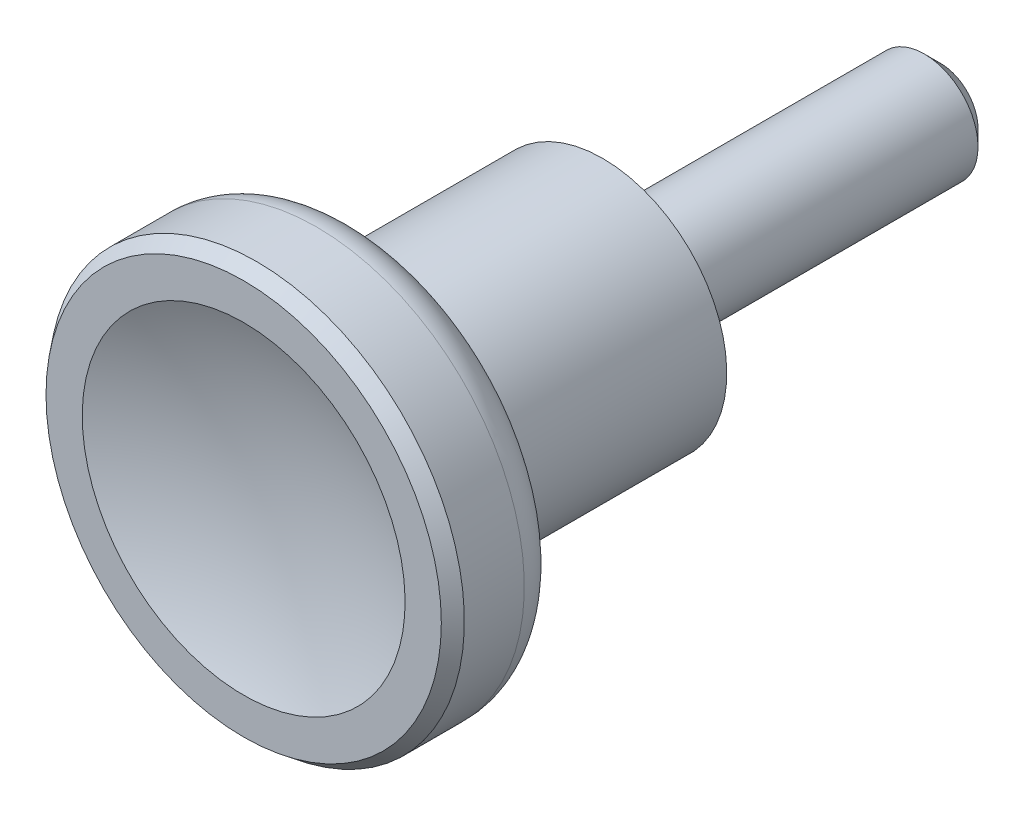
ISO-10303-21;
HEADER;
FILE_DESCRIPTION(('STEP AP214'),'2;1');
FILE_NAME('part.step','',(''),(''),'','','');
FILE_SCHEMA(('AUTOMOTIVE_DESIGN { 1 0 10303 214 1 1 1 1 }'));
ENDSEC;
DATA;
#1=APPLICATION_CONTEXT('core data for automotive mechanical design processes');
#2=APPLICATION_PROTOCOL_DEFINITION('international standard','automotive_design',2000,#1);
#3=PRODUCT_CONTEXT('',#1,'mechanical');
#4=PRODUCT('Part','Part','',(#3));
#5=PRODUCT_RELATED_PRODUCT_CATEGORY('part','',(#4));
#6=PRODUCT_DEFINITION_FORMATION('','',#4);
#7=PRODUCT_DEFINITION_CONTEXT('part definition',#1,'design');
#8=PRODUCT_DEFINITION('design','',#6,#7);
#9=PRODUCT_DEFINITION_SHAPE('','',#8);
#10=(LENGTH_UNIT() NAMED_UNIT(*) SI_UNIT(.MILLI.,.METRE.));
#11=(NAMED_UNIT(*) PLANE_ANGLE_UNIT() SI_UNIT($,.RADIAN.));
#12=(NAMED_UNIT(*) SI_UNIT($,.STERADIAN.) SOLID_ANGLE_UNIT());
#13=UNCERTAINTY_MEASURE_WITH_UNIT(LENGTH_MEASURE(1.E-05),#10,'distance_accuracy_value','');
#14=(GEOMETRIC_REPRESENTATION_CONTEXT(3) GLOBAL_UNCERTAINTY_ASSIGNED_CONTEXT((#13)) GLOBAL_UNIT_ASSIGNED_CONTEXT((#10,
#11,#12)) REPRESENTATION_CONTEXT('',''));
#15=CARTESIAN_POINT('',(0.,0.,0.));
#16=DIRECTION('',(0.,0.,1.));
#17=DIRECTION('',(1.,0.,0.));
#18=AXIS2_PLACEMENT_3D('',#15,#16,#17);
#19=CARTESIAN_POINT('',(9.25,0.,0.2));
#20=DIRECTION('',(0.,0.,1.));
#21=DIRECTION('',(0.,-1.,0.));
#22=AXIS2_PLACEMENT_3D('',#19,#20,#21);
#23=PLANE('',#22);
#24=CARTESIAN_POINT('',(0.,0.,0.2));
#25=DIRECTION('',(0.,0.,-1.));
#26=DIRECTION('',(0.,1.,0.));
#27=AXIS2_PLACEMENT_3D('',#24,#25,#26);
#28=CIRCLE('',#27,5.);
#29=CARTESIAN_POINT('',(0.,5.,0.2));
#30=VERTEX_POINT('',#29);
#31=EDGE_CURVE('E56',#30,#30,#28,.T.);
#32=ORIENTED_EDGE('',*,*,#31,.F.);
#33=EDGE_LOOP('',(#32));
#34=FACE_BOUND('',#33,.T.);
#35=CARTESIAN_POINT('',(0.,0.,0.2));
#36=DIRECTION('',(0.,0.,-1.));
#37=DIRECTION('',(0.,1.,0.));
#38=AXIS2_PLACEMENT_3D('',#35,#36,#37);
#39=CIRCLE('',#38,9.25);
#40=CARTESIAN_POINT('',(0.,9.25,0.2));
#41=VERTEX_POINT('',#40);
#42=EDGE_CURVE('E23',#41,#41,#39,.T.);
#43=ORIENTED_EDGE('',*,*,#42,.T.);
#44=EDGE_LOOP('',(#43));
#45=FACE_BOUND('',#44,.T.);
#46=ADVANCED_FACE('F12',(#34,#45),#23,.F.);
#47=CARTESIAN_POINT('',(0.,0.,-4.9324732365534));
#48=DIRECTION('',(0.,0.,-1.));
#49=DIRECTION('',(0.,1.,0.));
#50=AXIS2_PLACEMENT_3D('',#47,#48,#49);
#51=CYLINDRICAL_SURFACE('',#50,9.25);
#52=CARTESIAN_POINT('',(0.,0.,17.));
#53=DIRECTION('',(0.,0.,-1.));
#54=DIRECTION('',(0.,1.,0.));
#55=AXIS2_PLACEMENT_3D('',#52,#53,#54);
#56=CIRCLE('',#55,9.25);
#57=CARTESIAN_POINT('',(0.,9.25,17.));
#58=VERTEX_POINT('',#57);
#59=EDGE_CURVE('E27',#58,#58,#56,.T.);
#60=ORIENTED_EDGE('',*,*,#59,.T.);
#61=EDGE_LOOP('',(#60));
#62=FACE_BOUND('',#61,.T.);
#63=ORIENTED_EDGE('',*,*,#42,.F.);
#64=EDGE_LOOP('',(#63));
#65=FACE_BOUND('',#64,.T.);
#66=ADVANCED_FACE('F64',(#62,#65),#51,.T.);
#67=CARTESIAN_POINT('',(0.,0.,17.));
#68=DIRECTION('',(0.,0.,-1.));
#69=DIRECTION('',(0.,1.,0.));
#70=AXIS2_PLACEMENT_3D('',#67,#68,#69);
#71=TOROIDAL_SURFACE('',#70,10.0070026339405,0.757002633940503);
#72=ORIENTED_EDGE('',*,*,#59,.F.);
#73=EDGE_LOOP('',(#72));
#74=FACE_BOUND('',#73,.T.);
#75=CARTESIAN_POINT('',(0.,0.,17.7312080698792));
#76=DIRECTION('',(0.,0.,-1.));
#77=DIRECTION('',(0.,1.,0.));
#78=AXIS2_PLACEMENT_3D('',#75,#76,#77);
#79=CIRCLE('',#78,9.81107472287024);
#80=CARTESIAN_POINT('',(0.,9.81107472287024,17.7312080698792));
#81=VERTEX_POINT('',#80);
#82=EDGE_CURVE('E32',#81,#81,#79,.T.);
#83=ORIENTED_EDGE('',*,*,#82,.T.);
#84=EDGE_LOOP('',(#83));
#85=FACE_BOUND('',#84,.T.);
#86=ADVANCED_FACE('F68',(#74,#85),#71,.F.);
#87=CARTESIAN_POINT('',(0.,0.,17.7312080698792));
#88=DIRECTION('',(0.,0.,1.));
#89=DIRECTION('',(0.,-1.,0.));
#90=AXIS2_PLACEMENT_3D('',#87,#88,#89);
#91=CONICAL_SURFACE('',#90,9.81107472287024,1.30899528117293);
#92=CARTESIAN_POINT('',(0.,0.,18.6597619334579));
#93=DIRECTION('',(0.,0.,-1.));
#94=DIRECTION('',(0.,1.,0.));
#95=AXIS2_PLACEMENT_3D('',#92,#93,#94);
#96=CIRCLE('',#95,13.2764619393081);
#97=CARTESIAN_POINT('',(0.,13.2764619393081,18.6597619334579));
#98=VERTEX_POINT('',#97);
#99=EDGE_CURVE('E35',#98,#98,#96,.T.);
#100=ORIENTED_EDGE('',*,*,#99,.T.);
#101=EDGE_LOOP('',(#100));
#102=FACE_BOUND('',#101,.T.);
#103=ORIENTED_EDGE('',*,*,#82,.F.);
#104=EDGE_LOOP('',(#103));
#105=FACE_BOUND('',#104,.T.);
#106=ADVANCED_FACE('F76',(#102,#105),#91,.T.);
#107=CARTESIAN_POINT('',(0.,0.,21.5575381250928));
#108=DIRECTION('',(0.,0.,-1.));
#109=DIRECTION('',(0.,1.,0.));
#110=AXIS2_PLACEMENT_3D('',#107,#108,#109);
#111=TOROIDAL_SURFACE('',#110,12.5,3.);
#112=CARTESIAN_POINT('',(0.,0.,21.5575381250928));
#113=DIRECTION('',(0.,0.,-1.));
#114=DIRECTION('',(0.,1.,0.));
#115=AXIS2_PLACEMENT_3D('',#112,#113,#114);
#116=CIRCLE('',#115,15.5);
#117=CARTESIAN_POINT('',(0.,15.5,21.5575381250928));
#118=VERTEX_POINT('',#117);
#119=EDGE_CURVE('E38',#118,#118,#116,.T.);
#120=ORIENTED_EDGE('',*,*,#119,.T.);
#121=EDGE_LOOP('',(#120));
#122=FACE_BOUND('',#121,.T.);
#123=ORIENTED_EDGE('',*,*,#99,.F.);
#124=EDGE_LOOP('',(#123));
#125=FACE_BOUND('',#124,.T.);
#126=ADVANCED_FACE('F82',(#122,#125),#111,.T.);
#127=CARTESIAN_POINT('',(0.,0.,-4.9324732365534));
#128=DIRECTION('',(0.,0.,-1.));
#129=DIRECTION('',(0.,1.,0.));
#130=AXIS2_PLACEMENT_3D('',#127,#128,#129);
#131=CYLINDRICAL_SURFACE('',#130,15.5);
#132=CARTESIAN_POINT('',(0.,0.,26.0301314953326));
#133=DIRECTION('',(0.,0.,-1.));
#134=DIRECTION('',(0.,1.,0.));
#135=AXIS2_PLACEMENT_3D('',#132,#133,#134);
#136=CIRCLE('',#135,15.5);
#137=CARTESIAN_POINT('',(0.,15.5,26.0301314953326));
#138=VERTEX_POINT('',#137);
#139=EDGE_CURVE('E41',#138,#138,#136,.T.);
#140=ORIENTED_EDGE('',*,*,#139,.T.);
#141=EDGE_LOOP('',(#140));
#142=FACE_BOUND('',#141,.T.);
#143=ORIENTED_EDGE('',*,*,#119,.F.);
#144=EDGE_LOOP('',(#143));
#145=FACE_BOUND('',#144,.T.);
#146=ADVANCED_FACE('F86',(#142,#145),#131,.T.);
#147=CARTESIAN_POINT('',(0.,0.,27.));
#148=DIRECTION('',(0.,0.,-1.));
#149=DIRECTION('',(0.,1.,0.));
#150=AXIS2_PLACEMENT_3D('',#147,#148,#149);
#151=CONICAL_SURFACE('',#150,14.7507565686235,0.657759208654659);
#152=ORIENTED_EDGE('',*,*,#139,.F.);
#153=EDGE_LOOP('',(#152));
#154=FACE_BOUND('',#153,.T.);
#155=CARTESIAN_POINT('',(0.,0.,27.));
#156=DIRECTION('',(0.,0.,-1.));
#157=DIRECTION('',(0.,1.,0.));
#158=AXIS2_PLACEMENT_3D('',#155,#156,#157);
#159=CIRCLE('',#158,14.7507565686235);
#160=CARTESIAN_POINT('',(0.,14.7507565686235,27.));
#161=VERTEX_POINT('',#160);
#162=EDGE_CURVE('E44',#161,#161,#159,.T.);
#163=ORIENTED_EDGE('',*,*,#162,.T.);
#164=EDGE_LOOP('',(#163));
#165=FACE_BOUND('',#164,.T.);
#166=ADVANCED_FACE('F90',(#154,#165),#151,.T.);
#167=CARTESIAN_POINT('',(14.7507565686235,0.,27.));
#168=DIRECTION('',(0.,0.,1.));
#169=DIRECTION('',(0.,-1.,0.));
#170=AXIS2_PLACEMENT_3D('',#167,#168,#169);
#171=PLANE('',#170);
#172=CARTESIAN_POINT('',(0.,0.,27.));
#173=DIRECTION('',(0.,0.,-1.));
#174=DIRECTION('',(0.,1.,0.));
#175=AXIS2_PLACEMENT_3D('',#172,#173,#174);
#176=CIRCLE('',#175,12.0457822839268);
#177=CARTESIAN_POINT('',(0.,12.0457822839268,27.));
#178=VERTEX_POINT('',#177);
#179=EDGE_CURVE('E47',#178,#178,#176,.T.);
#180=ORIENTED_EDGE('',*,*,#179,.T.);
#181=EDGE_LOOP('',(#180));
#182=FACE_BOUND('',#181,.T.);
#183=ORIENTED_EDGE('',*,*,#162,.F.);
#184=EDGE_LOOP('',(#183));
#185=FACE_BOUND('',#184,.T.);
#186=ADVANCED_FACE('F94',(#182,#185),#171,.T.);
#187=CARTESIAN_POINT('',(0.,0.,54.5624551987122));
#188=DIRECTION('',(0.,-1.,0.));
#189=DIRECTION('',(1.,0.,0.));
#190=AXIS2_PLACEMENT_3D('',#187,#188,#189);
#191=SPHERICAL_SURFACE('',#190,30.0797241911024);
#192=CARTESIAN_POINT('',(0.,0.,54.5624551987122));
#193=DIRECTION('',(0.,0.,-1.));
#194=DIRECTION('',(0.,1.,0.));
#195=AXIS2_PLACEMENT_3D('',#192,#193,#194);
#196=SPHERICAL_SURFACE('',#195,30.0797241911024);
#197=ORIENTED_EDGE('',*,*,#179,.F.);
#198=EDGE_LOOP('',(#197));
#199=FACE_BOUND('',#198,.T.);
#200=ADVANCED_FACE('F98',(#199),#196,.F.);
#201=CARTESIAN_POINT('',(4.,0.,-25.));
#202=DIRECTION('',(0.,0.,1.));
#203=DIRECTION('',(0.,-1.,0.));
#204=AXIS2_PLACEMENT_3D('',#201,#202,#203);
#205=PLANE('',#204);
#206=CARTESIAN_POINT('',(0.,0.,-25.));
#207=DIRECTION('',(0.,0.,1.));
#208=DIRECTION('',(1.,0.,0.));
#209=AXIS2_PLACEMENT_3D('',#206,#207,#208);
#210=CIRCLE('',#209,2.8);
#211=CARTESIAN_POINT('',(2.8,0.,-25.));
#212=VERTEX_POINT('',#211);
#213=EDGE_CURVE('E19',#212,#212,#210,.F.);
#214=ORIENTED_EDGE('',*,*,#213,.T.);
#215=EDGE_LOOP('',(#214));
#216=FACE_BOUND('',#215,.T.);
#217=ADVANCED_FACE('F102',(#216),#205,.F.);
#218=CARTESIAN_POINT('',(0.,0.,-4.9324732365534));
#219=DIRECTION('',(0.,0.,-1.));
#220=DIRECTION('',(0.,1.,0.));
#221=AXIS2_PLACEMENT_3D('',#218,#219,#220);
#222=CYLINDRICAL_SURFACE('',#221,4.);
#223=CARTESIAN_POINT('',(0.,0.,-23.8));
#224=DIRECTION('',(0.,0.,1.));
#225=DIRECTION('',(1.,0.,0.));
#226=AXIS2_PLACEMENT_3D('',#223,#224,#225);
#227=CIRCLE('',#226,4.);
#228=CARTESIAN_POINT('',(4.,0.,-23.8));
#229=VERTEX_POINT('',#228);
#230=EDGE_CURVE('E8',#229,#229,#227,.T.);
#231=ORIENTED_EDGE('',*,*,#230,.T.);
#232=EDGE_LOOP('',(#231));
#233=FACE_BOUND('',#232,.T.);
#234=CARTESIAN_POINT('',(0.,0.,0.));
#235=DIRECTION('',(0.,0.,-1.));
#236=DIRECTION('',(0.,1.,0.));
#237=AXIS2_PLACEMENT_3D('',#234,#235,#236);
#238=CIRCLE('',#237,4.);
#239=CARTESIAN_POINT('',(0.,4.,0.));
#240=VERTEX_POINT('',#239);
#241=EDGE_CURVE('E50',#240,#240,#238,.T.);
#242=ORIENTED_EDGE('',*,*,#241,.T.);
#243=EDGE_LOOP('',(#242));
#244=FACE_BOUND('',#243,.T.);
#245=ADVANCED_FACE('F106',(#233,#244),#222,.T.);
#246=CARTESIAN_POINT('',(4.99999999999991,0.,0.));
#247=DIRECTION('',(0.,0.,1.));
#248=DIRECTION('',(0.,-1.,0.));
#249=AXIS2_PLACEMENT_3D('',#246,#247,#248);
#250=PLANE('',#249);
#251=ORIENTED_EDGE('',*,*,#241,.F.);
#252=EDGE_LOOP('',(#251));
#253=FACE_BOUND('',#252,.T.);
#254=CARTESIAN_POINT('',(0.,0.,0.));
#255=DIRECTION('',(0.,0.,-1.));
#256=DIRECTION('',(0.,1.,0.));
#257=AXIS2_PLACEMENT_3D('',#254,#255,#256);
#258=CIRCLE('',#257,5.);
#259=CARTESIAN_POINT('',(0.,5.,0.));
#260=VERTEX_POINT('',#259);
#261=EDGE_CURVE('E53',#260,#260,#258,.T.);
#262=ORIENTED_EDGE('',*,*,#261,.T.);
#263=EDGE_LOOP('',(#262));
#264=FACE_BOUND('',#263,.T.);
#265=ADVANCED_FACE('F109',(#253,#264),#250,.F.);
#266=CARTESIAN_POINT('',(0.,0.,-4.9324732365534));
#267=DIRECTION('',(0.,0.,-1.));
#268=DIRECTION('',(0.,1.,0.));
#269=AXIS2_PLACEMENT_3D('',#266,#267,#268);
#270=CYLINDRICAL_SURFACE('',#269,5.);
#271=ORIENTED_EDGE('',*,*,#261,.F.);
#272=EDGE_LOOP('',(#271));
#273=FACE_BOUND('',#272,.T.);
#274=ORIENTED_EDGE('',*,*,#31,.T.);
#275=EDGE_LOOP('',(#274));
#276=FACE_BOUND('',#275,.T.);
#277=ADVANCED_FACE('F60',(#273,#276),#270,.T.);
#278=CARTESIAN_POINT('',(0.,0.,-25.));
#279=DIRECTION('',(0.,0.,1.));
#280=DIRECTION('',(1.,0.,0.));
#281=AXIS2_PLACEMENT_3D('',#278,#279,#280);
#282=CONICAL_SURFACE('',#281,2.8,0.78539816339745);
#283=ORIENTED_EDGE('',*,*,#230,.F.);
#284=EDGE_LOOP('',(#283));
#285=FACE_BOUND('',#284,.T.);
#286=ORIENTED_EDGE('',*,*,#213,.F.);
#287=EDGE_LOOP('',(#286));
#288=FACE_BOUND('',#287,.T.);
#289=ADVANCED_FACE('F14',(#285,#288),#282,.T.);
#290=CLOSED_SHELL('',(#46,#66,#86,#106,#126,#146,#166,#186,#200,#217,#245,#265,#277,#289));
#291=MANIFOLD_SOLID_BREP('B1',#290);
#292=ADVANCED_BREP_SHAPE_REPRESENTATION('',(#18,#291),#14);
#293=SHAPE_DEFINITION_REPRESENTATION(#9,#292);
ENDSEC;
END-ISO-10303-21;
